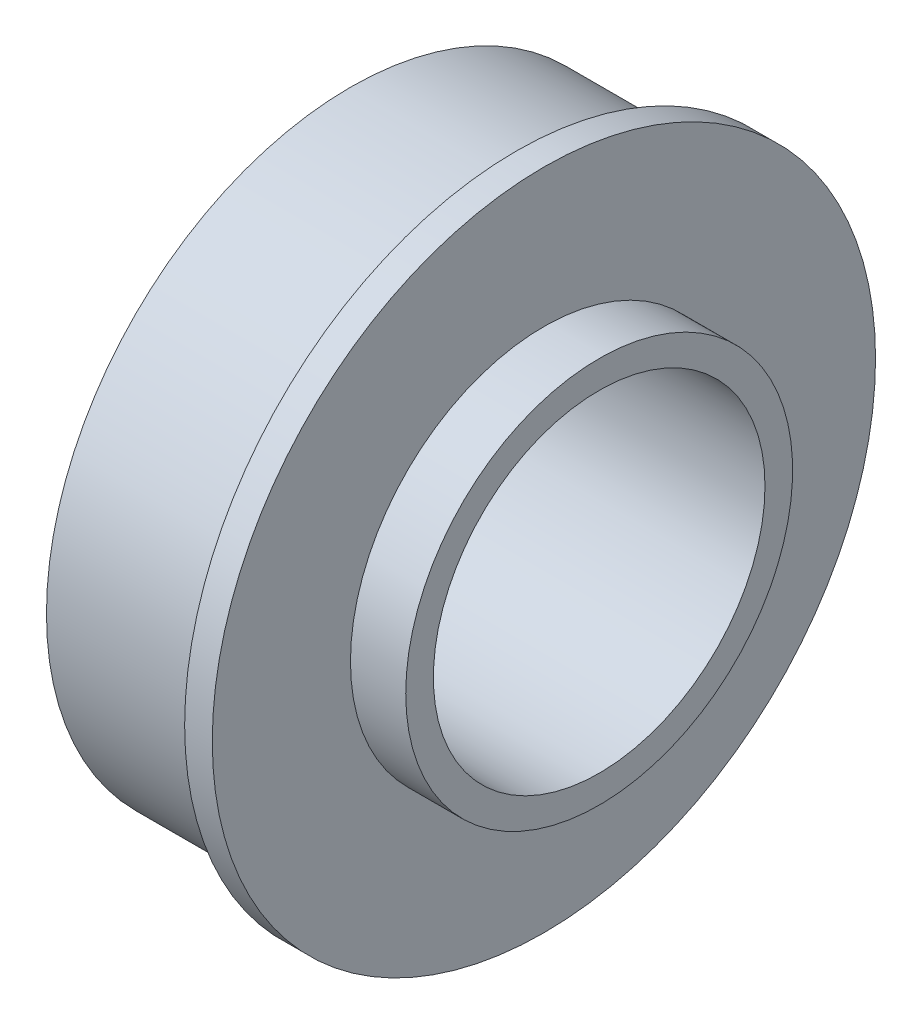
from build123d import *

# Parameters (mm, degrees)
BOSS_EXTRUDE1_DEPTH      = 1.5875
BOSS_EXTRUDE1_DEPTH_BACK = 9.525
SKETCH1_R                = 17.4625
SKETCH1_R_2              = 9.525
SKETCH1_3_R              = 19.05
SKETCH1_3_R_2            = 17.4625
SKETCH1_3_R_3            = 11.1125
SKETCH1_3_R_4            = 9.525
EXTRUDE_THIN1_DEPTH      = 1.5875
SKETCH1_4_R              = 11.1125
SKETCH1_4_R_2            = 9.525
EXTRUDE_THIN2_DEPTH      = 4.7625


with BuildPart() as part:
    # Sketch1 → Boss-Extrude1 (new, two sides: drawn at the far end of the back side and taken through both)
    with BuildSketch(Plane(origin=(0, 0, 0), x_dir=(0, 0, -1), z_dir=(1, 0, 0)).offset(-BOSS_EXTRUDE1_DEPTH_BACK)):
        Circle(SKETCH1_R)
        Circle(SKETCH1_R_2, mode=Mode.SUBTRACT)
    extrude(amount=BOSS_EXTRUDE1_DEPTH + BOSS_EXTRUDE1_DEPTH_BACK)

    # Sketch1_3 → Extrude-Thin1 (add)
    # profile 1 of 2: a face of its own
    with BuildSketch(Plane(origin=(0, 0, 0), x_dir=(0, 0, -1), z_dir=(1, 0, 0))):
        Circle(SKETCH1_3_R)
        Circle(SKETCH1_3_R_2, mode=Mode.SUBTRACT)
    # profile 2 of 2: a face of its own
    with BuildSketch(Plane(origin=(0, 0, 0), x_dir=(0, 0, -1), z_dir=(1, 0, 0))):
        Circle(SKETCH1_3_R_3)
        Circle(SKETCH1_3_R_4, mode=Mode.SUBTRACT)
    extrude(amount=EXTRUDE_THIN1_DEPTH)

    # Sketch1_4 → Extrude-Thin2 (add)
    with BuildSketch(Plane(origin=(0, 0, 0), x_dir=(0, 0, -1), z_dir=(1, 0, 0))):
        Circle(SKETCH1_4_R)
        Circle(SKETCH1_4_R_2, mode=Mode.SUBTRACT)
    extrude(amount=EXTRUDE_THIN2_DEPTH)


solid = part.part
